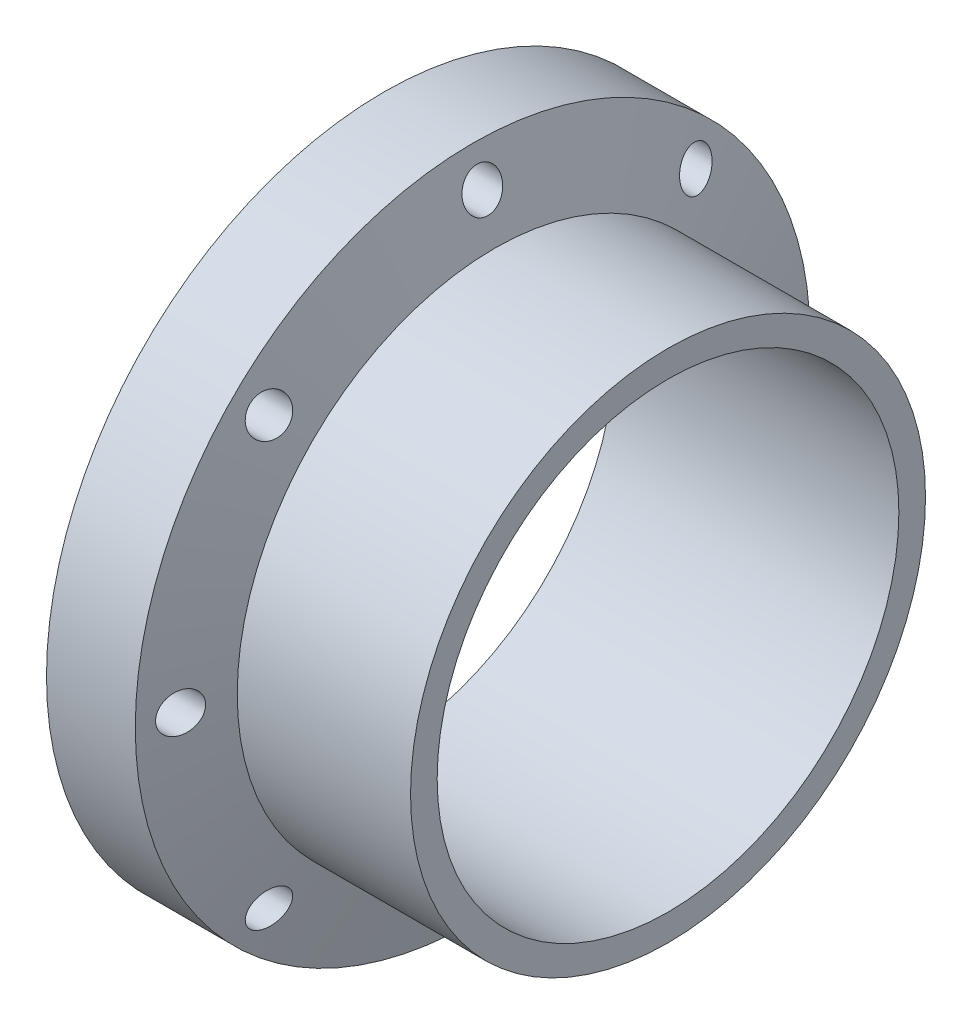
from build123d import *

# Parameters (mm, degrees)
SKETCH2_R             = 30.1625
SKETCH2_R_2           = 20.6375
EXTRUDE1_DEPTH        = 6.35
F_6_32_TAPPED_HOLE1_D = 3.5052


with BuildPart() as part:
    # Sketch1 → Revolve1 (revolve)
    with BuildSketch(Plane.XY, mode=Mode.PRIVATE) as revolve1_sk:
        Polygon((112.818274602, 23.01875), (97.327474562, 23.01875), (95.355774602, 30.1625), (93.768274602, 30.1625), (93.768274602, 20.6375), (112.818274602, 20.6375), align=None)
    revolve(revolve1_sk.sketch.rotate(Axis((125.720278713, 0, 0), (-1, 0, 0)), 90), axis=Axis((125.720278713, 0, 0), (-1, 0, 0)))

    # Sketch2 → Extrude1 (add)
    with BuildSketch(Plane.ZY.offset(-93.768274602)):
        with Locations(Location((0, 0, 0), (0, 0, 180))):
            Circle(SKETCH2_R)
        with Locations(Location((0, 0, 0), (0, 0, 180))):
            Circle(SKETCH2_R_2, mode=Mode.SUBTRACT)
    extrude(amount=EXTRUDE1_DEPTH)

    # 6-32 Tapped Hole1 (through all)
    with Locations(Plane.ZY.offset(-87.418274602)):
        with Locations((-26.9875, 0), (-19.083044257, -19.083044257), (0, -26.9875), (19.083044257, -19.083044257), (26.9875, 0), (19.083044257, 19.083044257), (0, 26.9875), (-19.083044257, 19.083044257)):
            Hole(F_6_32_TAPPED_HOLE1_D / 2)


solid = part.part
